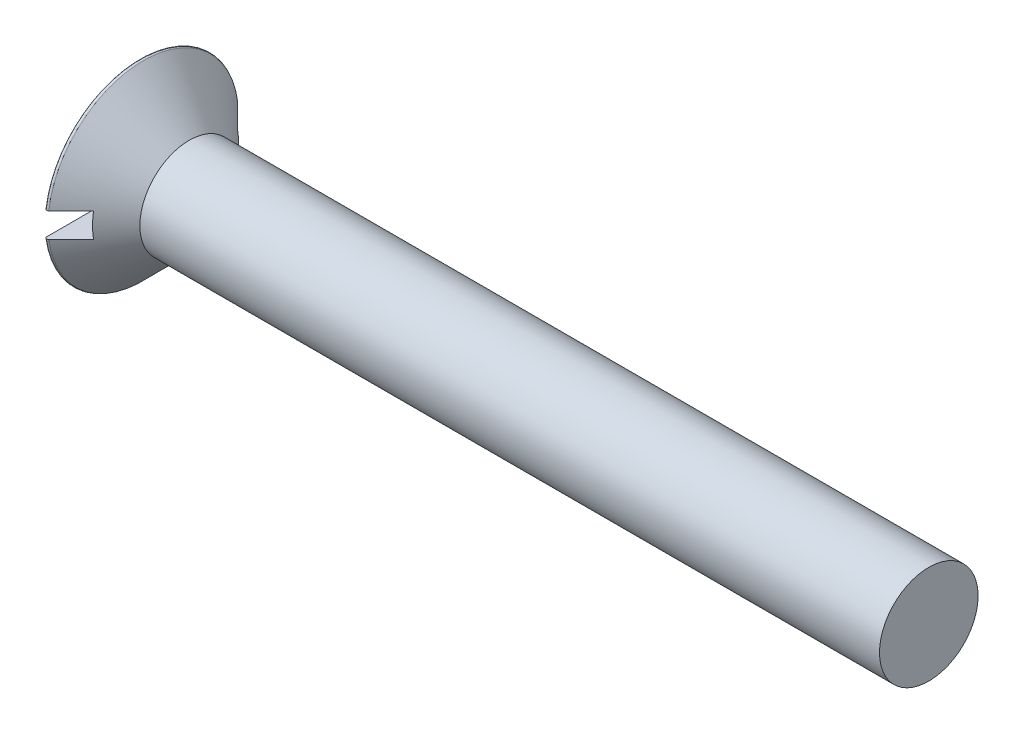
from build123d import *

# Parameters (mm, degrees)
HEADFILLET_R     = 0.2
NOTCH_DEPTH      = 82.171708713
NOTCH_DEPTH_BACK = 82.171708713
SKETCH2_W        = 2.6
SKETCH2_H        = 2.5


with BuildPart() as part:
    # Sketch1 → Base (revolve)
    with BuildSketch(Plane.XY, mode=Mode.PRIVATE) as base_sk:
        Polygon((0, 0), (0, 10), (5, 5), (80, 5), (80, 0), align=None)
    revolve(base_sk.sketch.rotate(Axis((-5.569640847, 0, 0), (1, 0, 0)), 90), axis=Axis((-5.569640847, 0, 0), (1, 0, 0)))

    # HeadFillet
    headfillet_edges = [part.edges().sort_by_distance(p)[0] for p in [
        (0, 0, -10),
    ]]
    fillet(headfillet_edges, radius=HEADFILLET_R)

    # Sketch2 → Notch (cut, two sides: drawn at the far end of the back side and taken through both)
    with BuildSketch(Plane.XY.offset(-NOTCH_DEPTH_BACK)):
        with Locations((1.3, 0)):
            Rectangle(SKETCH2_W, SKETCH2_H)
    extrude(amount=NOTCH_DEPTH + NOTCH_DEPTH_BACK, mode=Mode.SUBTRACT)


solid = part.part
